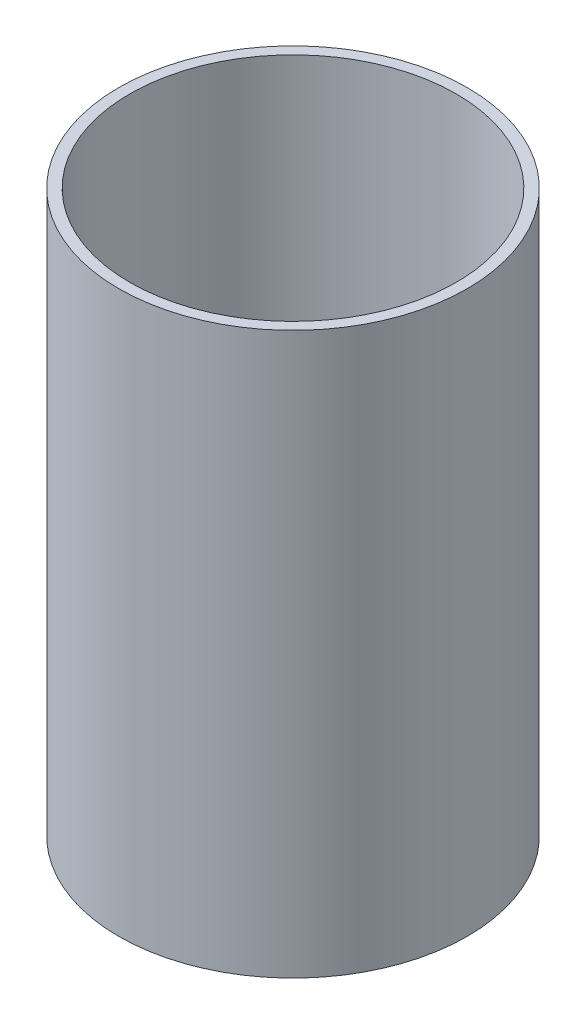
ISO-10303-21;
HEADER;
FILE_DESCRIPTION(('STEP AP214'),'2;1');
FILE_NAME('part.step','',(''),(''),'','','');
FILE_SCHEMA(('AUTOMOTIVE_DESIGN { 1 0 10303 214 1 1 1 1 }'));
ENDSEC;
DATA;
#1=APPLICATION_CONTEXT('core data for automotive mechanical design processes');
#2=APPLICATION_PROTOCOL_DEFINITION('international standard','automotive_design',2000,#1);
#3=PRODUCT_CONTEXT('',#1,'mechanical');
#4=PRODUCT('Part','Part','',(#3));
#5=PRODUCT_RELATED_PRODUCT_CATEGORY('part','',(#4));
#6=PRODUCT_DEFINITION_FORMATION('','',#4);
#7=PRODUCT_DEFINITION_CONTEXT('part definition',#1,'design');
#8=PRODUCT_DEFINITION('design','',#6,#7);
#9=PRODUCT_DEFINITION_SHAPE('','',#8);
#10=(LENGTH_UNIT() NAMED_UNIT(*) SI_UNIT(.MILLI.,.METRE.));
#11=(NAMED_UNIT(*) PLANE_ANGLE_UNIT() SI_UNIT($,.RADIAN.));
#12=(NAMED_UNIT(*) SI_UNIT($,.STERADIAN.) SOLID_ANGLE_UNIT());
#13=UNCERTAINTY_MEASURE_WITH_UNIT(LENGTH_MEASURE(1.E-05),#10,'distance_accuracy_value','');
#14=(GEOMETRIC_REPRESENTATION_CONTEXT(3) GLOBAL_UNCERTAINTY_ASSIGNED_CONTEXT((#13)) GLOBAL_UNIT_ASSIGNED_CONTEXT((#10,
#11,#12)) REPRESENTATION_CONTEXT('',''));
#15=CARTESIAN_POINT('',(0.,0.,0.));
#16=DIRECTION('',(0.,0.,1.));
#17=DIRECTION('',(1.,0.,0.));
#18=AXIS2_PLACEMENT_3D('',#15,#16,#17);
#19=CARTESIAN_POINT('',(0.,256.,0.));
#20=DIRECTION('',(0.,-1.,0.));
#21=DIRECTION('',(0.,0.,-1.));
#22=AXIS2_PLACEMENT_3D('',#19,#20,#21);
#23=CYLINDRICAL_SURFACE('',#22,74.5000000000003);
#24=CARTESIAN_POINT('',(0.,0.,0.));
#25=DIRECTION('',(0.,-1.,0.));
#26=DIRECTION('',(0.,0.,-1.));
#27=AXIS2_PLACEMENT_3D('',#24,#25,#26);
#28=CIRCLE('',#27,74.5000000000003);
#29=CARTESIAN_POINT('',(0.,0.,-74.5000000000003));
#30=VERTEX_POINT('',#29);
#31=EDGE_CURVE('E26',#30,#30,#28,.T.);
#32=ORIENTED_EDGE('',*,*,#31,.T.);
#33=EDGE_LOOP('',(#32));
#34=FACE_BOUND('',#33,.T.);
#35=CARTESIAN_POINT('',(0.,256.,0.));
#36=DIRECTION('',(0.,-1.,0.));
#37=DIRECTION('',(0.,0.,-1.));
#38=AXIS2_PLACEMENT_3D('',#35,#36,#37);
#39=CIRCLE('',#38,74.5000000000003);
#40=CARTESIAN_POINT('',(0.,256.,-74.5000000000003));
#41=VERTEX_POINT('',#40);
#42=EDGE_CURVE('E17',#41,#41,#39,.T.);
#43=ORIENTED_EDGE('',*,*,#42,.F.);
#44=EDGE_LOOP('',(#43));
#45=FACE_BOUND('',#44,.T.);
#46=ADVANCED_FACE('F14',(#34,#45),#23,.F.);
#47=CARTESIAN_POINT('',(0.,256.,0.));
#48=DIRECTION('',(0.,1.,0.));
#49=DIRECTION('',(0.,0.,1.));
#50=AXIS2_PLACEMENT_3D('',#47,#48,#49);
#51=PLANE('',#50);
#52=ORIENTED_EDGE('',*,*,#42,.T.);
#53=EDGE_LOOP('',(#52));
#54=FACE_BOUND('',#53,.T.);
#55=CARTESIAN_POINT('',(0.,256.,0.));
#56=DIRECTION('',(0.,-1.,0.));
#57=DIRECTION('',(0.,0.,-1.));
#58=AXIS2_PLACEMENT_3D('',#55,#56,#57);
#59=CIRCLE('',#58,79.5000000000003);
#60=CARTESIAN_POINT('',(0.,256.,-79.5000000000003));
#61=VERTEX_POINT('',#60);
#62=EDGE_CURVE('E21',#61,#61,#59,.T.);
#63=ORIENTED_EDGE('',*,*,#62,.F.);
#64=EDGE_LOOP('',(#63));
#65=FACE_BOUND('',#64,.T.);
#66=ADVANCED_FACE('F34',(#54,#65),#51,.T.);
#67=CARTESIAN_POINT('',(0.,0.,0.));
#68=DIRECTION('',(0.,1.,0.));
#69=DIRECTION('',(0.,0.,1.));
#70=AXIS2_PLACEMENT_3D('',#67,#68,#69);
#71=PLANE('',#70);
#72=ORIENTED_EDGE('',*,*,#31,.F.);
#73=EDGE_LOOP('',(#72));
#74=FACE_BOUND('',#73,.T.);
#75=CARTESIAN_POINT('',(0.,0.,0.));
#76=DIRECTION('',(0.,-1.,0.));
#77=DIRECTION('',(0.,0.,-1.));
#78=AXIS2_PLACEMENT_3D('',#75,#76,#77);
#79=CIRCLE('',#78,79.5000000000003);
#80=CARTESIAN_POINT('',(0.,0.,-79.5000000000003));
#81=VERTEX_POINT('',#80);
#82=EDGE_CURVE('E10',#81,#81,#79,.F.);
#83=ORIENTED_EDGE('',*,*,#82,.F.);
#84=EDGE_LOOP('',(#83));
#85=FACE_BOUND('',#84,.T.);
#86=ADVANCED_FACE('F41',(#74,#85),#71,.F.);
#87=CARTESIAN_POINT('',(0.,256.,0.));
#88=DIRECTION('',(0.,-1.,0.));
#89=DIRECTION('',(0.,0.,-1.));
#90=AXIS2_PLACEMENT_3D('',#87,#88,#89);
#91=CYLINDRICAL_SURFACE('',#90,79.5000000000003);
#92=ORIENTED_EDGE('',*,*,#82,.T.);
#93=EDGE_LOOP('',(#92));
#94=FACE_BOUND('',#93,.T.);
#95=ORIENTED_EDGE('',*,*,#62,.T.);
#96=EDGE_LOOP('',(#95));
#97=FACE_BOUND('',#96,.T.);
#98=ADVANCED_FACE('F42',(#94,#97),#91,.T.);
#99=CLOSED_SHELL('',(#46,#66,#86,#98));
#100=MANIFOLD_SOLID_BREP('B1',#99);
#101=ADVANCED_BREP_SHAPE_REPRESENTATION('',(#18,#100),#14);
#102=SHAPE_DEFINITION_REPRESENTATION(#9,#101);
ENDSEC;
END-ISO-10303-21;
